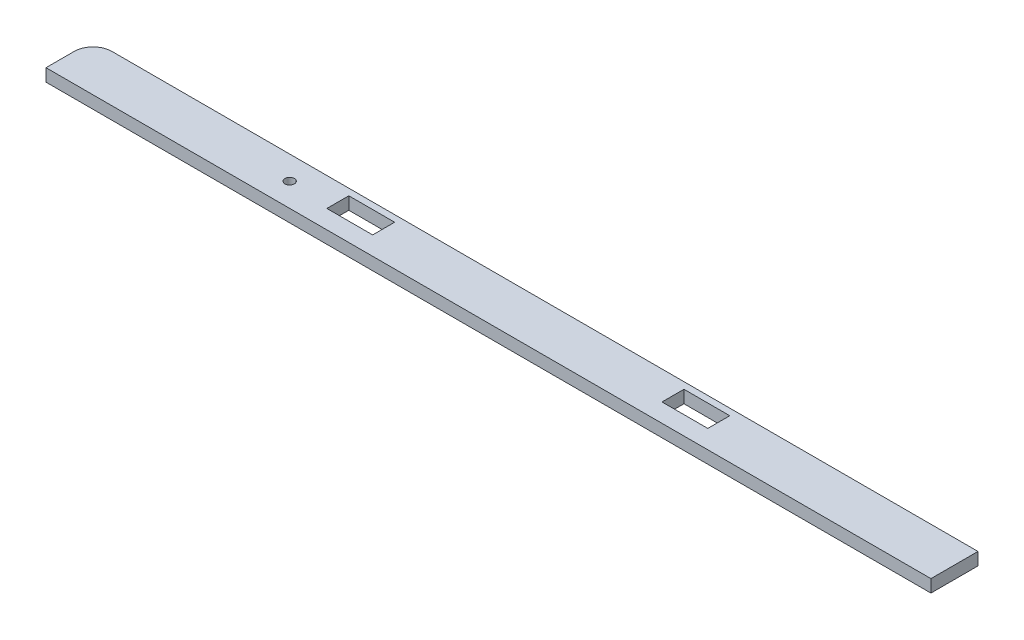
from build123d import *

# Parameters (mm, degrees)
SKETCH1_W               = 292
SKETCH1_H               = 15
SKETCH1_R               = 1.5
BOSS_EXTRUDE1_DEPTH     = 4
SKETCH2_W               = 14.6
SKETCH2_H               = 7
CUT_EXTRUDE1_DEPTH      = 194.540693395
SKETCH3_W               = 14.6
SKETCH3_H               = 7
CUT_EXTRUDE2_DEPTH      = 194.540693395
FILLET1_R               = 6
FILLET2_R               = 6
CUT_EXTRUDE3_DEPTH      = 10
CUT_EXTRUDE3_DEPTH_BACK = 10
SKETCH4_W               = 10
SKETCH4_H               = 15


with BuildPart() as part:
    # Sketch1 → Boss-Extrude1 (new body)
    with BuildSketch(Plane(origin=(0, 3, 0), x_dir=(1, 0, 0), z_dir=(0, 1, 0))):
        with Locations((5, 113.5)):
            Rectangle(SKETCH1_W, SKETCH1_H)
        with Locations(Location((-70.85, 113.5, 0), (0, 0, 270))):
            Circle(SKETCH1_R, mode=Mode.SUBTRACT)
    extrude(amount=-BOSS_EXTRUDE1_DEPTH)

    # Sketch2 → Cut-Extrude1 (cut, through all)
    with BuildSketch(Plane(origin=(0, 3, 0), x_dir=(-1, 0, 0), z_dir=(0, 1, 0))):
        with Locations((-56.7, -115.4)):
            Rectangle(SKETCH2_W, SKETCH2_H)
        with BuildLine():
            Line((-57.401923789, -116.9), (-53.4, -116.9))
            ThreePointArc((-53.4, -116.9), (-51.9, -115.4), (-53.4, -113.9))
            Line((-53.4, -113.9), (-57.401923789, -113.9))
            ThreePointArc((-57.401923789, -113.9), (-57, -115.4), (-57.401923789, -116.9))
        make_face(mode=Mode.SUBTRACT)
    extrude(amount=-CUT_EXTRUDE1_DEPTH, mode=Mode.SUBTRACT)


with BuildPart() as body_2:
    # of the pieces the cut leaves, the one that is kept (cut_extrude1_keep)
    add(part.part.solids().sort_by_distance((-141, 3, -106))[0])

    # Sketch3 → Cut-Extrude2 (cut, through all)
    with BuildSketch(Plane(origin=(0, 3, 0), x_dir=(-1, 0, 0), z_dir=(0, 1, 0))):
        with Locations((50.1, -115.4)):
            Rectangle(SKETCH3_W, SKETCH3_H)
        with BuildLine():
            Line((49.398076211, -116.9), (53.4, -116.9))
            ThreePointArc((53.4, -116.9), (54.9, -115.4), (53.4, -113.9))
            Line((53.4, -113.9), (49.398076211, -113.9))
            ThreePointArc((49.398076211, -113.9), (49.8, -115.4), (49.398076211, -116.9))
        make_face(mode=Mode.SUBTRACT)
    extrude(amount=-CUT_EXTRUDE2_DEPTH, mode=Mode.SUBTRACT)


with BuildPart() as body_2_2:
    # of the pieces the cut leaves, the one that is kept (cut_extrude2_keep)
    add(body_2.part.solids().sort_by_distance((-141, 3, -106))[0])

    # Fillet1
    fillet1_edges = [body_2_2.edges().sort_by_distance(p)[0] for p in [
        (-141, 1, -121),
    ]]
    fillet(fillet1_edges, radius=FILLET1_R)

    # Fillet2
    fillet2_edges = [body_2_2.edges().sort_by_distance(p)[0] for p in [
        (151, 1, -121),
    ]]
    fillet(fillet2_edges, radius=FILLET2_R)

    # Sketch4 → Cut-Extrude3 (cut, two sides: drawn at the far end of the back side and taken through both)
    with BuildSketch(Plane(origin=(0, 0, 0), x_dir=(1, 0, 0), z_dir=(0, 1, 0)).offset(-CUT_EXTRUDE3_DEPTH_BACK)):
        with Locations((146, 113.5)):
            Rectangle(SKETCH4_W, SKETCH4_H)
    extrude(amount=CUT_EXTRUDE3_DEPTH + CUT_EXTRUDE3_DEPTH_BACK, mode=Mode.SUBTRACT)


solid = body_2_2.part
